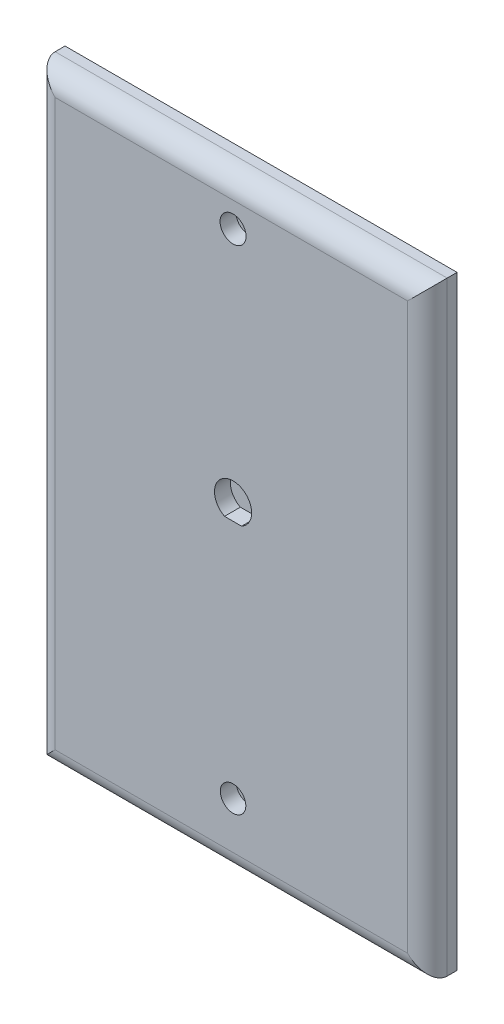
ISO-10303-21;
HEADER;
FILE_DESCRIPTION(('STEP AP214'),'2;1');
FILE_NAME('part.step','',(''),(''),'','','');
FILE_SCHEMA(('AUTOMOTIVE_DESIGN { 1 0 10303 214 1 1 1 1 }'));
ENDSEC;
DATA;
#1=APPLICATION_CONTEXT('core data for automotive mechanical design processes');
#2=APPLICATION_PROTOCOL_DEFINITION('international standard','automotive_design',2000,#1);
#3=PRODUCT_CONTEXT('',#1,'mechanical');
#4=PRODUCT('Part','Part','',(#3));
#5=PRODUCT_RELATED_PRODUCT_CATEGORY('part','',(#4));
#6=PRODUCT_DEFINITION_FORMATION('','',#4);
#7=PRODUCT_DEFINITION_CONTEXT('part definition',#1,'design');
#8=PRODUCT_DEFINITION('design','',#6,#7);
#9=PRODUCT_DEFINITION_SHAPE('','',#8);
#10=(LENGTH_UNIT() NAMED_UNIT(*) SI_UNIT(.MILLI.,.METRE.));
#11=(NAMED_UNIT(*) PLANE_ANGLE_UNIT() SI_UNIT($,.RADIAN.));
#12=(NAMED_UNIT(*) SI_UNIT($,.STERADIAN.) SOLID_ANGLE_UNIT());
#13=UNCERTAINTY_MEASURE_WITH_UNIT(LENGTH_MEASURE(1.E-05),#10,'distance_accuracy_value','');
#14=(GEOMETRIC_REPRESENTATION_CONTEXT(3) GLOBAL_UNCERTAINTY_ASSIGNED_CONTEXT((#13)) GLOBAL_UNIT_ASSIGNED_CONTEXT((#10,
#11,#12)) REPRESENTATION_CONTEXT('',''));
#15=CARTESIAN_POINT('',(0.,0.,0.));
#16=DIRECTION('',(0.,0.,1.));
#17=DIRECTION('',(1.,0.,0.));
#18=AXIS2_PLACEMENT_3D('',#15,#16,#17);
#19=CARTESIAN_POINT('',(-114.429040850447,144.440384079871,15.24));
#20=DIRECTION('',(1.,0.,0.));
#21=DIRECTION('',(0.,1.,0.));
#22=AXIS2_PLACEMENT_3D('',#19,#20,#21);
#23=PLANE('',#22);
#24=DIRECTION('',(0.,0.,-1.));
#25=VECTOR('',#24,1.);
#26=CARTESIAN_POINT('',(-114.429040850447,-165.871751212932,15.24));
#27=LINE('',#26,#25);
#28=CARTESIAN_POINT('',(-114.429040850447,-165.871751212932,5.08));
#29=VERTEX_POINT('',#28);
#30=CARTESIAN_POINT('',(-114.429040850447,-165.871751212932,0.));
#31=VERTEX_POINT('',#30);
#32=EDGE_CURVE('E150',#29,#31,#27,.T.);
#33=ORIENTED_EDGE('',*,*,#32,.F.);
#34=DIRECTION('',(0.,-1.,0.));
#35=VECTOR('',#34,1.);
#36=CARTESIAN_POINT('',(-114.429040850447,144.440384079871,5.08));
#37=LINE('',#36,#35);
#38=CARTESIAN_POINT('',(-114.429040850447,144.440384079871,5.08));
#39=VERTEX_POINT('',#38);
#40=EDGE_CURVE('E161',#29,#39,#37,.F.);
#41=ORIENTED_EDGE('',*,*,#40,.T.);
#42=DIRECTION('',(0.,0.,-1.));
#43=VECTOR('',#42,1.);
#44=CARTESIAN_POINT('',(-114.429040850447,144.440384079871,15.24));
#45=LINE('',#44,#43);
#46=CARTESIAN_POINT('',(-114.429040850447,144.440384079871,0.));
#47=VERTEX_POINT('',#46);
#48=EDGE_CURVE('E144',#39,#47,#45,.T.);
#49=ORIENTED_EDGE('',*,*,#48,.T.);
#50=DIRECTION('',(0.,-1.,0.));
#51=VECTOR('',#50,1.);
#52=CARTESIAN_POINT('',(-114.429040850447,144.440384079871,0.));
#53=LINE('',#52,#51);
#54=EDGE_CURVE('E130',#47,#31,#53,.T.);
#55=ORIENTED_EDGE('',*,*,#54,.T.);
#56=EDGE_LOOP('',(#33,#41,#49,#55));
#57=FACE_BOUND('',#56,.T.);
#58=ADVANCED_FACE('F31',(#57),#23,.F.);
#59=CARTESIAN_POINT('',(-114.429040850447,-165.871751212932,15.24));
#60=DIRECTION('',(0.,1.,0.));
#61=DIRECTION('',(0.,0.,1.));
#62=AXIS2_PLACEMENT_3D('',#59,#60,#61);
#63=PLANE('',#62);
#64=DIRECTION('',(0.,0.,-1.));
#65=VECTOR('',#64,1.);
#66=CARTESIAN_POINT('',(86.803470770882,-165.871751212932,15.24));
#67=LINE('',#66,#65);
#68=CARTESIAN_POINT('',(86.803470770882,-165.871751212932,5.08));
#69=VERTEX_POINT('',#68);
#70=CARTESIAN_POINT('',(86.803470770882,-165.871751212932,0.));
#71=VERTEX_POINT('',#70);
#72=EDGE_CURVE('E148',#69,#71,#67,.T.);
#73=ORIENTED_EDGE('',*,*,#72,.F.);
#74=DIRECTION('',(1.,0.,0.));
#75=VECTOR('',#74,1.);
#76=CARTESIAN_POINT('',(-114.429040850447,-165.871751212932,5.08));
#77=LINE('',#76,#75);
#78=EDGE_CURVE('E164',#69,#29,#77,.F.);
#79=ORIENTED_EDGE('',*,*,#78,.T.);
#80=ORIENTED_EDGE('',*,*,#32,.T.);
#81=DIRECTION('',(1.,0.,0.));
#82=VECTOR('',#81,1.);
#83=CARTESIAN_POINT('',(-114.429040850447,-165.871751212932,0.));
#84=LINE('',#83,#82);
#85=EDGE_CURVE('E135',#31,#71,#84,.T.);
#86=ORIENTED_EDGE('',*,*,#85,.T.);
#87=EDGE_LOOP('',(#73,#79,#80,#86));
#88=FACE_BOUND('',#87,.T.);
#89=ADVANCED_FACE('F188',(#88),#63,.F.);
#90=CARTESIAN_POINT('',(86.803470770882,144.440384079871,15.24));
#91=DIRECTION('',(-1.,0.,0.));
#92=DIRECTION('',(0.,0.,1.));
#93=AXIS2_PLACEMENT_3D('',#90,#91,#92);
#94=PLANE('',#93);
#95=DIRECTION('',(0.,0.,-1.));
#96=VECTOR('',#95,1.);
#97=CARTESIAN_POINT('',(86.803470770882,144.440384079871,15.24));
#98=LINE('',#97,#96);
#99=CARTESIAN_POINT('',(86.803470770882,144.440384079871,5.08));
#100=VERTEX_POINT('',#99);
#101=CARTESIAN_POINT('',(86.803470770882,144.440384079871,0.));
#102=VERTEX_POINT('',#101);
#103=EDGE_CURVE('E146',#100,#102,#98,.T.);
#104=ORIENTED_EDGE('',*,*,#103,.F.);
#105=DIRECTION('',(0.,1.,0.));
#106=VECTOR('',#105,1.);
#107=CARTESIAN_POINT('',(86.803470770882,-165.871751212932,5.08));
#108=LINE('',#107,#106);
#109=EDGE_CURVE('E40',#100,#69,#108,.F.);
#110=ORIENTED_EDGE('',*,*,#109,.T.);
#111=ORIENTED_EDGE('',*,*,#72,.T.);
#112=DIRECTION('',(0.,1.,0.));
#113=VECTOR('',#112,1.);
#114=CARTESIAN_POINT('',(86.803470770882,144.440384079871,0.));
#115=LINE('',#114,#113);
#116=EDGE_CURVE('E138',#71,#102,#115,.T.);
#117=ORIENTED_EDGE('',*,*,#116,.T.);
#118=EDGE_LOOP('',(#104,#110,#111,#117));
#119=FACE_BOUND('',#118,.T.);
#120=ADVANCED_FACE('F228',(#119),#94,.F.);
#121=CARTESIAN_POINT('',(-114.429040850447,144.440384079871,15.24));
#122=DIRECTION('',(0.,-1.,0.));
#123=DIRECTION('',(0.,0.,-1.));
#124=AXIS2_PLACEMENT_3D('',#121,#122,#123);
#125=PLANE('',#124);
#126=ORIENTED_EDGE('',*,*,#48,.F.);
#127=DIRECTION('',(-1.,0.,0.));
#128=VECTOR('',#127,1.);
#129=CARTESIAN_POINT('',(86.803470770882,144.440384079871,5.08));
#130=LINE('',#129,#128);
#131=EDGE_CURVE('E11',#39,#100,#130,.F.);
#132=ORIENTED_EDGE('',*,*,#131,.T.);
#133=ORIENTED_EDGE('',*,*,#103,.T.);
#134=DIRECTION('',(-1.,0.,0.));
#135=VECTOR('',#134,1.);
#136=CARTESIAN_POINT('',(-114.429040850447,144.440384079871,0.));
#137=LINE('',#136,#135);
#138=EDGE_CURVE('E141',#102,#47,#137,.T.);
#139=ORIENTED_EDGE('',*,*,#138,.T.);
#140=EDGE_LOOP('',(#126,#132,#133,#139));
#141=FACE_BOUND('',#140,.T.);
#142=ADVANCED_FACE('F201',(#141),#125,.F.);
#143=CARTESIAN_POINT('',(-114.429040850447,-165.871751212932,15.24));
#144=DIRECTION('',(0.,0.,1.));
#145=DIRECTION('',(1.,0.,0.));
#146=AXIS2_PLACEMENT_3D('',#143,#144,#145);
#147=PLANE('',#146);
#148=DIRECTION('',(-1.,0.,0.));
#149=VECTOR('',#148,1.);
#150=CARTESIAN_POINT('',(-114.429040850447,134.280384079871,15.24));
#151=LINE('',#150,#149);
#152=CARTESIAN_POINT('',(76.643470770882,134.280384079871,15.24));
#153=VERTEX_POINT('',#152);
#154=CARTESIAN_POINT('',(-104.269040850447,134.280384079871,15.24));
#155=VERTEX_POINT('',#154);
#156=EDGE_CURVE('E152',#153,#155,#151,.T.);
#157=ORIENTED_EDGE('',*,*,#156,.T.);
#158=DIRECTION('',(0.,-1.,0.));
#159=VECTOR('',#158,1.);
#160=CARTESIAN_POINT('',(-104.269040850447,-165.871751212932,15.24));
#161=LINE('',#160,#159);
#162=CARTESIAN_POINT('',(-104.269040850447,-155.711751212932,15.24));
#163=VERTEX_POINT('',#162);
#164=EDGE_CURVE('E158',#155,#163,#161,.T.);
#165=ORIENTED_EDGE('',*,*,#164,.T.);
#166=DIRECTION('',(1.,0.,0.));
#167=VECTOR('',#166,1.);
#168=CARTESIAN_POINT('',(86.803470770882,-155.711751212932,15.24));
#169=LINE('',#168,#167);
#170=CARTESIAN_POINT('',(76.643470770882,-155.711751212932,15.24));
#171=VERTEX_POINT('',#170);
#172=EDGE_CURVE('E156',#163,#171,#169,.T.);
#173=ORIENTED_EDGE('',*,*,#172,.T.);
#174=DIRECTION('',(0.,1.,0.));
#175=VECTOR('',#174,1.);
#176=CARTESIAN_POINT('',(76.643470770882,144.440384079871,15.24));
#177=LINE('',#176,#175);
#178=EDGE_CURVE('E154',#171,#153,#177,.T.);
#179=ORIENTED_EDGE('',*,*,#178,.T.);
#180=EDGE_LOOP('',(#157,#165,#173,#179));
#181=FACE_BOUND('',#180,.T.);
#182=CARTESIAN_POINT('',(-12.9354259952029,0.,15.24));
#183=DIRECTION('',(0.,0.,1.));
#184=DIRECTION('',(1.,0.,0.));
#185=AXIS2_PLACEMENT_3D('',#182,#183,#184);
#186=CIRCLE('',#185,9.525);
#187=CARTESIAN_POINT('',(-8.54286496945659,-8.45168815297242,15.24));
#188=VERTEX_POINT('',#187);
#189=CARTESIAN_POINT('',(-17.3279870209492,-8.45168815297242,15.24));
#190=VERTEX_POINT('',#189);
#191=EDGE_CURVE('E102',#188,#190,#186,.T.);
#192=ORIENTED_EDGE('',*,*,#191,.F.);
#193=DIRECTION('',(1.,0.,0.));
#194=VECTOR('',#193,1.);
#195=CARTESIAN_POINT('',(-17.3279870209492,-8.45168815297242,15.24));
#196=LINE('',#195,#194);
#197=EDGE_CURVE('E112',#190,#188,#196,.T.);
#198=ORIENTED_EDGE('',*,*,#197,.F.);
#199=EDGE_LOOP('',(#192,#198));
#200=FACE_BOUND('',#199,.T.);
#201=CARTESIAN_POINT('',(-12.9354259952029,-131.710621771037,15.24));
#202=DIRECTION('',(0.,0.,1.));
#203=DIRECTION('',(1.,0.,0.));
#204=AXIS2_PLACEMENT_3D('',#201,#202,#203);
#205=CIRCLE('',#204,6.54884368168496);
#206=CARTESIAN_POINT('',(-6.38658231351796,-131.710621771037,15.24));
#207=VERTEX_POINT('',#206);
#208=EDGE_CURVE('E119',#207,#207,#205,.T.);
#209=ORIENTED_EDGE('',*,*,#208,.F.);
#210=EDGE_LOOP('',(#209));
#211=FACE_BOUND('',#210,.T.);
#212=CARTESIAN_POINT('',(-12.9354259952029,121.483730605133,15.24));
#213=DIRECTION('',(0.,0.,1.));
#214=DIRECTION('',(1.,0.,0.));
#215=AXIS2_PLACEMENT_3D('',#212,#213,#214);
#216=CIRCLE('',#215,6.67270718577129);
#217=CARTESIAN_POINT('',(-6.26271880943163,121.483730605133,15.24));
#218=VERTEX_POINT('',#217);
#219=EDGE_CURVE('E124',#218,#218,#216,.T.);
#220=ORIENTED_EDGE('',*,*,#219,.F.);
#221=EDGE_LOOP('',(#220));
#222=FACE_BOUND('',#221,.T.);
#223=ADVANCED_FACE('F197',(#181,#200,#211,#222),#147,.T.);
#224=CARTESIAN_POINT('',(-114.429040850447,-165.871751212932,0.));
#225=DIRECTION('',(0.,0.,1.));
#226=DIRECTION('',(1.,0.,0.));
#227=AXIS2_PLACEMENT_3D('',#224,#225,#226);
#228=PLANE('',#227);
#229=ORIENTED_EDGE('',*,*,#54,.F.);
#230=ORIENTED_EDGE('',*,*,#138,.F.);
#231=ORIENTED_EDGE('',*,*,#116,.F.);
#232=ORIENTED_EDGE('',*,*,#85,.F.);
#233=EDGE_LOOP('',(#229,#230,#231,#232));
#234=FACE_BOUND('',#233,.T.);
#235=ADVANCED_FACE('F200',(#234),#228,.F.);
#236=CARTESIAN_POINT('',(-12.9354259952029,121.483730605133,7.11199999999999));
#237=DIRECTION('',(0.,0.,1.));
#238=DIRECTION('',(1.,0.,0.));
#239=AXIS2_PLACEMENT_3D('',#236,#237,#238);
#240=CYLINDRICAL_SURFACE('',#239,6.67270718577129);
#241=CARTESIAN_POINT('',(-12.9354259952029,121.483730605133,7.11199999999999));
#242=DIRECTION('',(0.,0.,1.));
#243=DIRECTION('',(1.,0.,0.));
#244=AXIS2_PLACEMENT_3D('',#241,#242,#243);
#245=CIRCLE('',#244,6.67270718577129);
#246=CARTESIAN_POINT('',(-6.26271880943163,121.483730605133,7.11199999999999));
#247=VERTEX_POINT('',#246);
#248=EDGE_CURVE('E127',#247,#247,#245,.T.);
#249=ORIENTED_EDGE('',*,*,#248,.F.);
#250=EDGE_LOOP('',(#249));
#251=FACE_BOUND('',#250,.T.);
#252=ORIENTED_EDGE('',*,*,#219,.T.);
#253=EDGE_LOOP('',(#252));
#254=FACE_BOUND('',#253,.T.);
#255=ADVANCED_FACE('F208',(#251,#254),#240,.F.);
#256=CARTESIAN_POINT('',(-12.9354259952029,121.483730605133,7.11199999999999));
#257=DIRECTION('',(0.,0.,1.));
#258=DIRECTION('',(1.,0.,0.));
#259=AXIS2_PLACEMENT_3D('',#256,#257,#258);
#260=PLANE('',#259);
#261=ORIENTED_EDGE('',*,*,#248,.T.);
#262=EDGE_LOOP('',(#261));
#263=FACE_BOUND('',#262,.T.);
#264=ADVANCED_FACE('F210',(#263),#260,.T.);
#265=CARTESIAN_POINT('',(-12.9354259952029,-131.710621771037,7.11199999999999));
#266=DIRECTION('',(0.,0.,1.));
#267=DIRECTION('',(1.,0.,0.));
#268=AXIS2_PLACEMENT_3D('',#265,#266,#267);
#269=CYLINDRICAL_SURFACE('',#268,6.54884368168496);
#270=CARTESIAN_POINT('',(-12.9354259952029,-131.710621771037,7.11199999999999));
#271=DIRECTION('',(0.,0.,1.));
#272=DIRECTION('',(1.,0.,0.));
#273=AXIS2_PLACEMENT_3D('',#270,#271,#272);
#274=CIRCLE('',#273,6.54884368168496);
#275=CARTESIAN_POINT('',(-6.38658231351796,-131.710621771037,7.11199999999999));
#276=VERTEX_POINT('',#275);
#277=EDGE_CURVE('E121',#276,#276,#274,.T.);
#278=ORIENTED_EDGE('',*,*,#277,.F.);
#279=EDGE_LOOP('',(#278));
#280=FACE_BOUND('',#279,.T.);
#281=ORIENTED_EDGE('',*,*,#208,.T.);
#282=EDGE_LOOP('',(#281));
#283=FACE_BOUND('',#282,.T.);
#284=ADVANCED_FACE('F217',(#280,#283),#269,.F.);
#285=CARTESIAN_POINT('',(-12.9354259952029,-131.710621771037,7.11199999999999));
#286=DIRECTION('',(0.,0.,1.));
#287=DIRECTION('',(1.,0.,0.));
#288=AXIS2_PLACEMENT_3D('',#285,#286,#287);
#289=PLANE('',#288);
#290=ORIENTED_EDGE('',*,*,#277,.T.);
#291=EDGE_LOOP('',(#290));
#292=FACE_BOUND('',#291,.T.);
#293=ADVANCED_FACE('F250',(#292),#289,.T.);
#294=CARTESIAN_POINT('',(-12.9354259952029,0.,7.11199999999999));
#295=DIRECTION('',(0.,0.,1.));
#296=DIRECTION('',(1.,0.,0.));
#297=AXIS2_PLACEMENT_3D('',#294,#295,#296);
#298=CYLINDRICAL_SURFACE('',#297,9.525);
#299=ORIENTED_EDGE('',*,*,#191,.T.);
#300=DIRECTION('',(0.,0.,1.));
#301=VECTOR('',#300,1.);
#302=CARTESIAN_POINT('',(-17.3279870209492,-8.45168815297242,7.11199999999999));
#303=LINE('',#302,#301);
#304=CARTESIAN_POINT('',(-17.3279870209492,-8.45168815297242,7.11199999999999));
#305=VERTEX_POINT('',#304);
#306=EDGE_CURVE('E96',#305,#190,#303,.T.);
#307=ORIENTED_EDGE('',*,*,#306,.F.);
#308=CARTESIAN_POINT('',(-12.9354259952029,0.,7.11199999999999));
#309=DIRECTION('',(0.,0.,1.));
#310=DIRECTION('',(1.,0.,0.));
#311=AXIS2_PLACEMENT_3D('',#308,#309,#310);
#312=CIRCLE('',#311,9.525);
#313=CARTESIAN_POINT('',(-8.54286496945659,-8.45168815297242,7.11199999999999));
#314=VERTEX_POINT('',#313);
#315=EDGE_CURVE('E99',#314,#305,#312,.T.);
#316=ORIENTED_EDGE('',*,*,#315,.F.);
#317=DIRECTION('',(0.,0.,1.));
#318=VECTOR('',#317,1.);
#319=CARTESIAN_POINT('',(-8.54286496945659,-8.45168815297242,7.11199999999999));
#320=LINE('',#319,#318);
#321=EDGE_CURVE('E107',#314,#188,#320,.T.);
#322=ORIENTED_EDGE('',*,*,#321,.T.);
#323=EDGE_LOOP('',(#299,#307,#316,#322));
#324=FACE_BOUND('',#323,.T.);
#325=ADVANCED_FACE('F98',(#324),#298,.F.);
#326=CARTESIAN_POINT('',(-17.3279870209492,-8.45168815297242,7.11199999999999));
#327=DIRECTION('',(0.,-1.,0.));
#328=DIRECTION('',(0.,0.,-1.));
#329=AXIS2_PLACEMENT_3D('',#326,#327,#328);
#330=PLANE('',#329);
#331=ORIENTED_EDGE('',*,*,#197,.T.);
#332=ORIENTED_EDGE('',*,*,#321,.F.);
#333=DIRECTION('',(1.,0.,0.));
#334=VECTOR('',#333,1.);
#335=CARTESIAN_POINT('',(-17.3279870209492,-8.45168815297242,7.11199999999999));
#336=LINE('',#335,#334);
#337=EDGE_CURVE('E108',#305,#314,#336,.T.);
#338=ORIENTED_EDGE('',*,*,#337,.F.);
#339=ORIENTED_EDGE('',*,*,#306,.T.);
#340=EDGE_LOOP('',(#331,#332,#338,#339));
#341=FACE_BOUND('',#340,.T.);
#342=ADVANCED_FACE('F114',(#341),#330,.F.);
#343=CARTESIAN_POINT('',(-12.9354259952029,0.,7.11199999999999));
#344=DIRECTION('',(0.,0.,1.));
#345=DIRECTION('',(1.,0.,0.));
#346=AXIS2_PLACEMENT_3D('',#343,#344,#345);
#347=PLANE('',#346);
#348=ORIENTED_EDGE('',*,*,#315,.T.);
#349=ORIENTED_EDGE('',*,*,#337,.T.);
#350=EDGE_LOOP('',(#348,#349));
#351=FACE_BOUND('',#350,.T.);
#352=ADVANCED_FACE('F111',(#351),#347,.T.);
#353=CARTESIAN_POINT('',(76.643470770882,-165.871751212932,5.08));
#354=DIRECTION('',(0.,-1.,0.));
#355=DIRECTION('',(0.,0.,-1.));
#356=AXIS2_PLACEMENT_3D('',#353,#354,#355);
#357=CYLINDRICAL_SURFACE('',#356,10.16);
#358=CARTESIAN_POINT('',(76.643470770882,-155.711751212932,5.08));
#359=DIRECTION('',(-0.707106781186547,-0.707106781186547,0.));
#360=DIRECTION('',(0.707106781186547,-0.707106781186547,0.));
#361=AXIS2_PLACEMENT_3D('',#358,#359,#360);
#362=ELLIPSE('',#361,14.3684097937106,10.16);
#363=EDGE_CURVE('E170',#69,#171,#362,.T.);
#364=ORIENTED_EDGE('',*,*,#363,.F.);
#365=ORIENTED_EDGE('',*,*,#109,.F.);
#366=CARTESIAN_POINT('',(76.643470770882,134.280384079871,5.08));
#367=DIRECTION('',(0.707106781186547,-0.707106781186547,0.));
#368=DIRECTION('',(0.707106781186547,0.707106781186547,0.));
#369=AXIS2_PLACEMENT_3D('',#366,#367,#368);
#370=ELLIPSE('',#369,14.3684097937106,10.16);
#371=EDGE_CURVE('E35',#153,#100,#370,.F.);
#372=ORIENTED_EDGE('',*,*,#371,.F.);
#373=ORIENTED_EDGE('',*,*,#178,.F.);
#374=EDGE_LOOP('',(#364,#365,#372,#373));
#375=FACE_BOUND('',#374,.T.);
#376=ADVANCED_FACE('F33',(#375),#357,.T.);
#377=CARTESIAN_POINT('',(-114.429040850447,134.280384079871,5.08));
#378=DIRECTION('',(1.,0.,0.));
#379=DIRECTION('',(0.,0.,-1.));
#380=AXIS2_PLACEMENT_3D('',#377,#378,#379);
#381=CYLINDRICAL_SURFACE('',#380,10.16);
#382=ORIENTED_EDGE('',*,*,#371,.T.);
#383=ORIENTED_EDGE('',*,*,#131,.F.);
#384=CARTESIAN_POINT('',(-104.269040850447,134.280384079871,5.08));
#385=DIRECTION('',(0.707106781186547,0.707106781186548,0.));
#386=DIRECTION('',(0.707106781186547,-0.707106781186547,0.));
#387=AXIS2_PLACEMENT_3D('',#384,#385,#386);
#388=ELLIPSE('',#387,14.3684097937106,10.16);
#389=EDGE_CURVE('E169',#155,#39,#388,.F.);
#390=ORIENTED_EDGE('',*,*,#389,.F.);
#391=ORIENTED_EDGE('',*,*,#156,.F.);
#392=EDGE_LOOP('',(#382,#383,#390,#391));
#393=FACE_BOUND('',#392,.T.);
#394=ADVANCED_FACE('F180',(#393),#381,.T.);
#395=CARTESIAN_POINT('',(-114.429040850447,-155.711751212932,5.08));
#396=DIRECTION('',(-1.,0.,0.));
#397=DIRECTION('',(0.,0.,1.));
#398=AXIS2_PLACEMENT_3D('',#395,#396,#397);
#399=CYLINDRICAL_SURFACE('',#398,10.16);
#400=ORIENTED_EDGE('',*,*,#363,.T.);
#401=ORIENTED_EDGE('',*,*,#172,.F.);
#402=CARTESIAN_POINT('',(-104.269040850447,-155.711751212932,5.08));
#403=DIRECTION('',(-0.707106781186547,0.707106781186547,0.));
#404=DIRECTION('',(-0.707106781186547,-0.707106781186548,0.));
#405=AXIS2_PLACEMENT_3D('',#402,#403,#404);
#406=ELLIPSE('',#405,14.3684097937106,10.16);
#407=EDGE_CURVE('E167',#29,#163,#406,.T.);
#408=ORIENTED_EDGE('',*,*,#407,.F.);
#409=ORIENTED_EDGE('',*,*,#78,.F.);
#410=EDGE_LOOP('',(#400,#401,#408,#409));
#411=FACE_BOUND('',#410,.T.);
#412=ADVANCED_FACE('F185',(#411),#399,.T.);
#413=CARTESIAN_POINT('',(-104.269040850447,-165.871751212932,5.08));
#414=DIRECTION('',(0.,1.,0.));
#415=DIRECTION('',(-1.,0.,0.));
#416=AXIS2_PLACEMENT_3D('',#413,#414,#415);
#417=CYLINDRICAL_SURFACE('',#416,10.16);
#418=ORIENTED_EDGE('',*,*,#389,.T.);
#419=ORIENTED_EDGE('',*,*,#40,.F.);
#420=ORIENTED_EDGE('',*,*,#407,.T.);
#421=ORIENTED_EDGE('',*,*,#164,.F.);
#422=EDGE_LOOP('',(#418,#419,#420,#421));
#423=FACE_BOUND('',#422,.T.);
#424=ADVANCED_FACE('F194',(#423),#417,.T.);
#425=CLOSED_SHELL('',(#58,#89,#120,#142,#223,#235,#255,#264,#284,#293,#325,#342,#352,#376,#394,
#412,#424));
#426=MANIFOLD_SOLID_BREP('B2',#425);
#427=ADVANCED_BREP_SHAPE_REPRESENTATION('',(#18,#426),#14);
#428=SHAPE_DEFINITION_REPRESENTATION(#9,#427);
ENDSEC;
END-ISO-10303-21;
